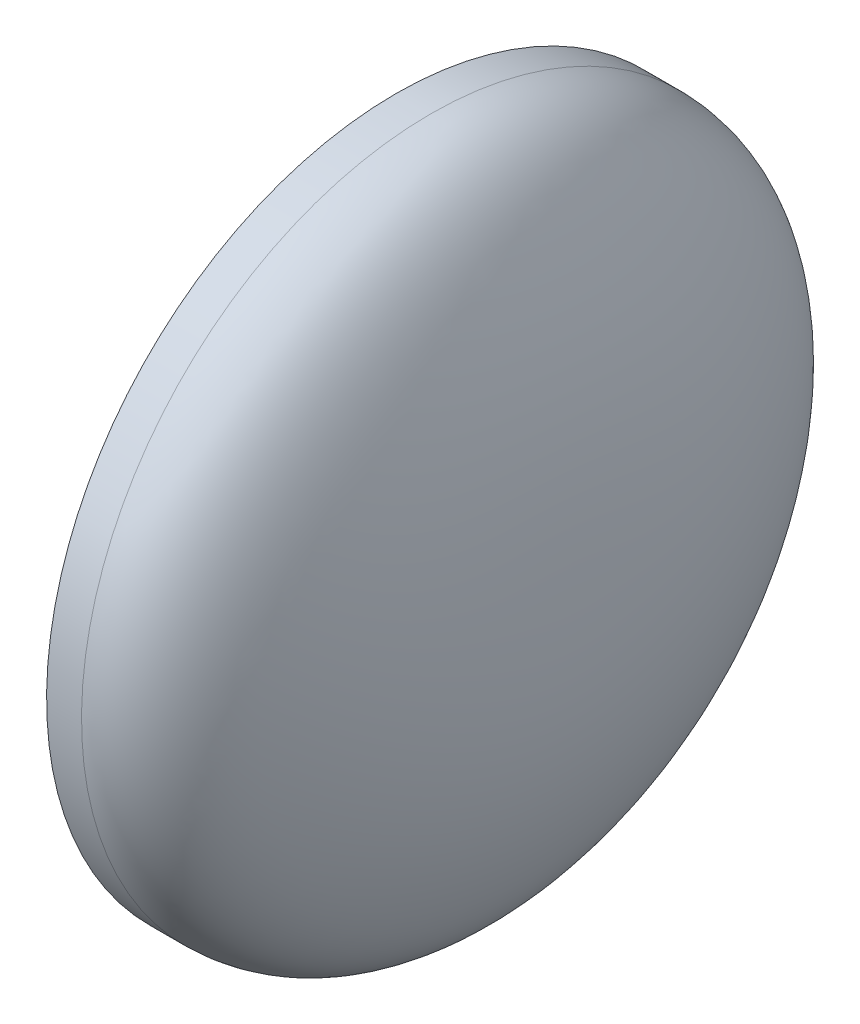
ISO-10303-21;
HEADER;
FILE_DESCRIPTION(('STEP AP214'),'2;1');
FILE_NAME('part.step','',(''),(''),'','','');
FILE_SCHEMA(('AUTOMOTIVE_DESIGN { 1 0 10303 214 1 1 1 1 }'));
ENDSEC;
DATA;
#1=APPLICATION_CONTEXT('core data for automotive mechanical design processes');
#2=APPLICATION_PROTOCOL_DEFINITION('international standard','automotive_design',2000,#1);
#3=PRODUCT_CONTEXT('',#1,'mechanical');
#4=PRODUCT('Part','Part','',(#3));
#5=PRODUCT_RELATED_PRODUCT_CATEGORY('part','',(#4));
#6=PRODUCT_DEFINITION_FORMATION('','',#4);
#7=PRODUCT_DEFINITION_CONTEXT('part definition',#1,'design');
#8=PRODUCT_DEFINITION('design','',#6,#7);
#9=PRODUCT_DEFINITION_SHAPE('','',#8);
#10=(LENGTH_UNIT() NAMED_UNIT(*) SI_UNIT(.MILLI.,.METRE.));
#11=(NAMED_UNIT(*) PLANE_ANGLE_UNIT() SI_UNIT($,.RADIAN.));
#12=(NAMED_UNIT(*) SI_UNIT($,.STERADIAN.) SOLID_ANGLE_UNIT());
#13=UNCERTAINTY_MEASURE_WITH_UNIT(LENGTH_MEASURE(1.E-05),#10,'distance_accuracy_value','');
#14=(GEOMETRIC_REPRESENTATION_CONTEXT(3) GLOBAL_UNCERTAINTY_ASSIGNED_CONTEXT((#13)) GLOBAL_UNIT_ASSIGNED_CONTEXT((#10,
#11,#12)) REPRESENTATION_CONTEXT('',''));
#15=CARTESIAN_POINT('',(0.,0.,0.));
#16=DIRECTION('',(0.,0.,1.));
#17=DIRECTION('',(1.,0.,0.));
#18=AXIS2_PLACEMENT_3D('',#15,#16,#17);
#19=CARTESIAN_POINT('',(2.5,0.,0.));
#20=CARTESIAN_POINT('',(2.5,1.27610953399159,0.));
#21=CARTESIAN_POINT('',(2.38203669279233,3.05048141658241,0.));
#22=CARTESIAN_POINT('',(1.25248107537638,5.,0.));
#23=CARTESIAN_POINT('',(0.5,5.,0.));
#24=B_SPLINE_CURVE_WITH_KNOTS('',3,(#19,#20,#21,#22,#23),.UNSPECIFIED.,.F.,.F.,(4,1,4),(0.,
0.66394628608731,1.),.UNSPECIFIED.);
#25=CARTESIAN_POINT('',(2.5,0.,0.));
#26=DIRECTION('',(1.,0.,0.));
#27=AXIS1_PLACEMENT('',#25,#26);
#28=SURFACE_OF_REVOLUTION('',#24,#27);
#29=CARTESIAN_POINT('',(0.5,0.,0.));
#30=DIRECTION('',(1.,0.,0.));
#31=DIRECTION('',(0.,1.,0.));
#32=AXIS2_PLACEMENT_3D('',#29,#30,#31);
#33=CIRCLE('',#32,5.);
#34=CARTESIAN_POINT('',(0.5,5.,0.));
#35=VERTEX_POINT('',#34);
#36=EDGE_CURVE('E11',#35,#35,#33,.T.);
#37=ORIENTED_EDGE('',*,*,#36,.T.);
#38=EDGE_LOOP('',(#37));
#39=FACE_BOUND('',#38,.T.);
#40=CARTESIAN_POINT('',(2.5,0.,0.));
#41=VERTEX_POINT('',#40);
#42=VERTEX_LOOP('',#41);
#43=FACE_BOUND('',#42,.T.);
#44=ADVANCED_FACE('F31',(#39,#43),#28,.F.);
#45=CARTESIAN_POINT('',(2.5,0.,0.));
#46=DIRECTION('',(1.,0.,0.));
#47=DIRECTION('',(0.,1.,0.));
#48=AXIS2_PLACEMENT_3D('',#45,#46,#47);
#49=CYLINDRICAL_SURFACE('',#48,5.);
#50=CARTESIAN_POINT('',(0.,0.,0.));
#51=DIRECTION('',(1.,0.,0.));
#52=DIRECTION('',(0.,1.,0.));
#53=AXIS2_PLACEMENT_3D('',#50,#51,#52);
#54=CIRCLE('',#53,5.);
#55=CARTESIAN_POINT('',(0.,5.,0.));
#56=VERTEX_POINT('',#55);
#57=EDGE_CURVE('E38',#56,#56,#54,.T.);
#58=ORIENTED_EDGE('',*,*,#57,.T.);
#59=EDGE_LOOP('',(#58));
#60=FACE_BOUND('',#59,.T.);
#61=ORIENTED_EDGE('',*,*,#36,.F.);
#62=EDGE_LOOP('',(#61));
#63=FACE_BOUND('',#62,.T.);
#64=ADVANCED_FACE('F42',(#60,#63),#49,.T.);
#65=CARTESIAN_POINT('',(0.,0.,0.));
#66=DIRECTION('',(-1.,0.,0.));
#67=DIRECTION('',(0.,-1.,0.));
#68=AXIS2_PLACEMENT_3D('',#65,#66,#67);
#69=PLANE('',#68);
#70=ORIENTED_EDGE('',*,*,#57,.F.);
#71=EDGE_LOOP('',(#70));
#72=FACE_BOUND('',#71,.T.);
#73=ADVANCED_FACE('F47',(#72),#69,.T.);
#74=CLOSED_SHELL('',(#44,#64,#73));
#75=MANIFOLD_SOLID_BREP('B2',#74);
#76=ADVANCED_BREP_SHAPE_REPRESENTATION('',(#18,#75),#14);
#77=SHAPE_DEFINITION_REPRESENTATION(#9,#76);
ENDSEC;
END-ISO-10303-21;
